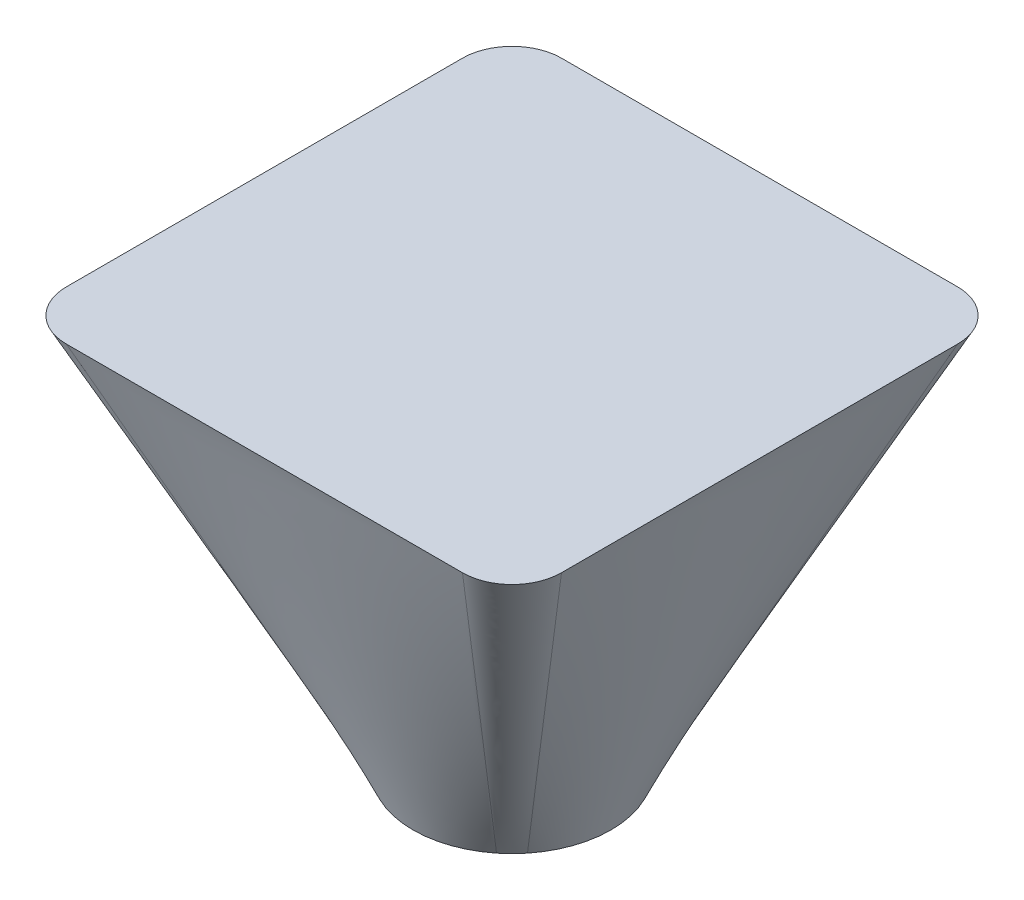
ISO-10303-21;
HEADER;
FILE_DESCRIPTION(('STEP AP214'),'2;1');
FILE_NAME('part.step','',(''),(''),'','','');
FILE_SCHEMA(('AUTOMOTIVE_DESIGN { 1 0 10303 214 1 1 1 1 }'));
ENDSEC;
DATA;
#1=APPLICATION_CONTEXT('core data for automotive mechanical design processes');
#2=APPLICATION_PROTOCOL_DEFINITION('international standard','automotive_design',2000,#1);
#3=PRODUCT_CONTEXT('',#1,'mechanical');
#4=PRODUCT('Part','Part','',(#3));
#5=PRODUCT_RELATED_PRODUCT_CATEGORY('part','',(#4));
#6=PRODUCT_DEFINITION_FORMATION('','',#4);
#7=PRODUCT_DEFINITION_CONTEXT('part definition',#1,'design');
#8=PRODUCT_DEFINITION('design','',#6,#7);
#9=PRODUCT_DEFINITION_SHAPE('','',#8);
#10=(LENGTH_UNIT() NAMED_UNIT(*) SI_UNIT(.MILLI.,.METRE.));
#11=(NAMED_UNIT(*) PLANE_ANGLE_UNIT() SI_UNIT($,.RADIAN.));
#12=(NAMED_UNIT(*) SI_UNIT($,.STERADIAN.) SOLID_ANGLE_UNIT());
#13=UNCERTAINTY_MEASURE_WITH_UNIT(LENGTH_MEASURE(1.E-05),#10,'distance_accuracy_value','');
#14=(GEOMETRIC_REPRESENTATION_CONTEXT(3) GLOBAL_UNCERTAINTY_ASSIGNED_CONTEXT((#13)) GLOBAL_UNIT_ASSIGNED_CONTEXT((#10,
#11,#12)) REPRESENTATION_CONTEXT('',''));
#15=CARTESIAN_POINT('',(0.,0.,0.));
#16=DIRECTION('',(0.,0.,1.));
#17=DIRECTION('',(1.,0.,0.));
#18=AXIS2_PLACEMENT_3D('',#15,#16,#17);
#19=CARTESIAN_POINT('',(-40.,0.,-40.));
#20=DIRECTION('',(0.,-1.,0.));
#21=DIRECTION('',(0.,0.,-1.));
#22=AXIS2_PLACEMENT_3D('',#19,#20,#21);
#23=PLANE('',#22);
#24=CARTESIAN_POINT('',(-40.,0.,-40.));
#25=DIRECTION('',(0.,1.,0.));
#26=DIRECTION('',(0.,0.,-1.));
#27=AXIS2_PLACEMENT_3D('',#24,#25,#26);
#28=CIRCLE('',#27,10.);
#29=CARTESIAN_POINT('',(-39.9999999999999,0.,-50.));
#30=VERTEX_POINT('',#29);
#31=CARTESIAN_POINT('',(-50.,0.,-39.9999999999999));
#32=VERTEX_POINT('',#31);
#33=EDGE_CURVE('E212',#30,#32,#28,.T.);
#34=ORIENTED_EDGE('',*,*,#33,.T.);
#35=DIRECTION('',(0.,0.,1.));
#36=VECTOR('',#35,1.);
#37=CARTESIAN_POINT('',(-50.,0.,39.9999999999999));
#38=LINE('',#37,#36);
#39=CARTESIAN_POINT('',(-50.,0.,39.9999999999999));
#40=VERTEX_POINT('',#39);
#41=EDGE_CURVE('E457',#32,#40,#38,.T.);
#42=ORIENTED_EDGE('',*,*,#41,.T.);
#43=CARTESIAN_POINT('',(-40.,0.,40.));
#44=DIRECTION('',(0.,1.,0.));
#45=DIRECTION('',(0.,0.,-1.));
#46=AXIS2_PLACEMENT_3D('',#43,#44,#45);
#47=CIRCLE('',#46,10.);
#48=CARTESIAN_POINT('',(-39.9999999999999,0.,50.));
#49=VERTEX_POINT('',#48);
#50=EDGE_CURVE('E449',#40,#49,#47,.T.);
#51=ORIENTED_EDGE('',*,*,#50,.T.);
#52=DIRECTION('',(1.,0.,0.));
#53=VECTOR('',#52,1.);
#54=CARTESIAN_POINT('',(-39.9999999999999,0.,50.));
#55=LINE('',#54,#53);
#56=CARTESIAN_POINT('',(39.9999999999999,0.,50.));
#57=VERTEX_POINT('',#56);
#58=EDGE_CURVE('E441',#49,#57,#55,.T.);
#59=ORIENTED_EDGE('',*,*,#58,.T.);
#60=CARTESIAN_POINT('',(40.,0.,40.));
#61=DIRECTION('',(0.,1.,0.));
#62=DIRECTION('',(0.,0.,1.));
#63=AXIS2_PLACEMENT_3D('',#60,#61,#62);
#64=CIRCLE('',#63,10.);
#65=CARTESIAN_POINT('',(50.,0.,39.9999999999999));
#66=VERTEX_POINT('',#65);
#67=EDGE_CURVE('E421',#57,#66,#64,.T.);
#68=ORIENTED_EDGE('',*,*,#67,.T.);
#69=DIRECTION('',(0.,0.,-1.));
#70=VECTOR('',#69,1.);
#71=CARTESIAN_POINT('',(50.,0.,39.9999999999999));
#72=LINE('',#71,#70);
#73=CARTESIAN_POINT('',(50.,0.,-39.9999999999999));
#74=VERTEX_POINT('',#73);
#75=EDGE_CURVE('E358',#66,#74,#72,.T.);
#76=ORIENTED_EDGE('',*,*,#75,.T.);
#77=CARTESIAN_POINT('',(40.,0.,-40.));
#78=DIRECTION('',(0.,1.,0.));
#79=DIRECTION('',(0.,0.,-1.));
#80=AXIS2_PLACEMENT_3D('',#77,#78,#79);
#81=CIRCLE('',#80,10.);
#82=CARTESIAN_POINT('',(39.9999999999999,0.,-50.));
#83=VERTEX_POINT('',#82);
#84=EDGE_CURVE('E157',#74,#83,#81,.T.);
#85=ORIENTED_EDGE('',*,*,#84,.T.);
#86=DIRECTION('',(-1.,0.,0.));
#87=VECTOR('',#86,1.);
#88=CARTESIAN_POINT('',(-39.9999999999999,0.,-50.));
#89=LINE('',#88,#87);
#90=EDGE_CURVE('E162',#83,#30,#89,.T.);
#91=ORIENTED_EDGE('',*,*,#90,.T.);
#92=EDGE_LOOP('',(#34,#42,#51,#59,#68,#76,#85,#91));
#93=FACE_BOUND('',#92,.T.);
#94=ADVANCED_FACE('F109',(#93),#23,.F.);
#95=CARTESIAN_POINT('',(0.,-80.,0.));
#96=DIRECTION('',(0.,1.,0.));
#97=DIRECTION('',(0.,0.,1.));
#98=AXIS2_PLACEMENT_3D('',#95,#96,#97);
#99=PLANE('',#98);
#100=CARTESIAN_POINT('',(0.,-80.,0.));
#101=DIRECTION('',(0.,1.,0.));
#102=DIRECTION('',(0.,0.,1.));
#103=AXIS2_PLACEMENT_3D('',#100,#101,#102);
#104=CIRCLE('',#103,20.);
#105=CARTESIAN_POINT('',(-15.6173761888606,-80.,12.4939009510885));
#106=VERTEX_POINT('',#105);
#107=CARTESIAN_POINT('',(-12.4939009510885,-80.,15.6173761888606));
#108=VERTEX_POINT('',#107);
#109=EDGE_CURVE('E268',#106,#108,#104,.T.);
#110=ORIENTED_EDGE('',*,*,#109,.F.);
#111=CARTESIAN_POINT('',(0.,-80.,0.));
#112=DIRECTION('',(0.,1.,0.));
#113=DIRECTION('',(0.,0.,1.));
#114=AXIS2_PLACEMENT_3D('',#111,#112,#113);
#115=CIRCLE('',#114,20.);
#116=CARTESIAN_POINT('',(-15.6173761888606,-80.,-12.4939009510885));
#117=VERTEX_POINT('',#116);
#118=EDGE_CURVE('E12',#117,#106,#115,.T.);
#119=ORIENTED_EDGE('',*,*,#118,.F.);
#120=CARTESIAN_POINT('',(0.,-80.,0.));
#121=DIRECTION('',(0.,1.,0.));
#122=DIRECTION('',(0.,0.,1.));
#123=AXIS2_PLACEMENT_3D('',#120,#121,#122);
#124=CIRCLE('',#123,20.);
#125=CARTESIAN_POINT('',(-12.4939009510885,-80.,-15.6173761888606));
#126=VERTEX_POINT('',#125);
#127=EDGE_CURVE('E120',#126,#117,#124,.T.);
#128=ORIENTED_EDGE('',*,*,#127,.F.);
#129=CARTESIAN_POINT('',(0.,-80.,0.));
#130=DIRECTION('',(0.,1.,0.));
#131=DIRECTION('',(0.,0.,1.));
#132=AXIS2_PLACEMENT_3D('',#129,#130,#131);
#133=CIRCLE('',#132,20.);
#134=CARTESIAN_POINT('',(12.4939009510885,-80.,-15.6173761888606));
#135=VERTEX_POINT('',#134);
#136=EDGE_CURVE('E189',#135,#126,#133,.T.);
#137=ORIENTED_EDGE('',*,*,#136,.F.);
#138=CARTESIAN_POINT('',(0.,-80.,0.));
#139=DIRECTION('',(0.,1.,0.));
#140=DIRECTION('',(0.,0.,1.));
#141=AXIS2_PLACEMENT_3D('',#138,#139,#140);
#142=CIRCLE('',#141,20.);
#143=CARTESIAN_POINT('',(15.6173761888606,-80.,-12.4939009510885));
#144=VERTEX_POINT('',#143);
#145=EDGE_CURVE('E207',#144,#135,#142,.T.);
#146=ORIENTED_EDGE('',*,*,#145,.F.);
#147=CARTESIAN_POINT('',(0.,-80.,0.));
#148=DIRECTION('',(0.,1.,0.));
#149=DIRECTION('',(0.,0.,1.));
#150=AXIS2_PLACEMENT_3D('',#147,#148,#149);
#151=CIRCLE('',#150,20.);
#152=CARTESIAN_POINT('',(15.6173761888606,-80.,12.4939009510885));
#153=VERTEX_POINT('',#152);
#154=EDGE_CURVE('E336',#153,#144,#151,.T.);
#155=ORIENTED_EDGE('',*,*,#154,.F.);
#156=CARTESIAN_POINT('',(0.,-80.,0.));
#157=DIRECTION('',(0.,1.,0.));
#158=DIRECTION('',(0.,0.,1.));
#159=AXIS2_PLACEMENT_3D('',#156,#157,#158);
#160=CIRCLE('',#159,20.);
#161=CARTESIAN_POINT('',(12.4939009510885,-80.,15.6173761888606));
#162=VERTEX_POINT('',#161);
#163=EDGE_CURVE('E333',#162,#153,#160,.T.);
#164=ORIENTED_EDGE('',*,*,#163,.F.);
#165=CARTESIAN_POINT('',(0.,-80.,0.));
#166=DIRECTION('',(0.,1.,0.));
#167=DIRECTION('',(0.,0.,1.));
#168=AXIS2_PLACEMENT_3D('',#165,#166,#167);
#169=CIRCLE('',#168,20.);
#170=EDGE_CURVE('E172',#108,#162,#169,.T.);
#171=ORIENTED_EDGE('',*,*,#170,.F.);
#172=EDGE_LOOP('',(#110,#119,#128,#137,#146,#155,#164,#171));
#173=FACE_BOUND('',#172,.T.);
#174=ADVANCED_FACE('F188',(#173),#99,.F.);
#175=CARTESIAN_POINT('',(15.6173761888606,-80.,12.4939009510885));
#176=CARTESIAN_POINT('',(50.,0.,39.9999999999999));
#177=CARTESIAN_POINT('',(16.2677826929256,-80.,11.6808928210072));
#178=CARTESIAN_POINT('',(50.,0.,36.6666666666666));
#179=CARTESIAN_POINT('',(16.8724921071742,-80.,10.7942079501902));
#180=CARTESIAN_POINT('',(50.,0.,33.3333333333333));
#181=CARTESIAN_POINT('',(17.9488157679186,-80.,8.89021527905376));
#182=CARTESIAN_POINT('',(50.,0.,26.6666666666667));
#183=CARTESIAN_POINT('',(18.4202066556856,-80.,7.87291514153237));
#184=CARTESIAN_POINT('',(50.,0.,23.3333333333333));
#185=CARTESIAN_POINT('',(19.1922902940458,-80.,5.73958180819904));
#186=CARTESIAN_POINT('',(50.,0.,16.6666666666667));
#187=CARTESIAN_POINT('',(19.4927686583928,-80.,4.623675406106));
#188=CARTESIAN_POINT('',(50.,0.,13.3333333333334));
#189=CARTESIAN_POINT('',(19.8966899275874,-80.,2.33840419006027));
#190=CARTESIAN_POINT('',(50.,0.,6.66666666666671));
#191=CARTESIAN_POINT('',(20.,-80.,1.16927019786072));
#192=CARTESIAN_POINT('',(50.,0.,3.33333333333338));
#193=CARTESIAN_POINT('',(20.,-80.,-1.1692701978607));
#194=CARTESIAN_POINT('',(50.,0.,-3.33333333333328));
#195=CARTESIAN_POINT('',(19.8966899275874,-80.,-2.33840419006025));
#196=CARTESIAN_POINT('',(50.,0.,-6.6666666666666));
#197=CARTESIAN_POINT('',(19.4927686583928,-80.,-4.62367540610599));
#198=CARTESIAN_POINT('',(50.,0.,-13.3333333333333));
#199=CARTESIAN_POINT('',(19.1922902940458,-80.,-5.73958180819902));
#200=CARTESIAN_POINT('',(50.,0.,-16.6666666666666));
#201=CARTESIAN_POINT('',(18.4202066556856,-80.,-7.87291514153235));
#202=CARTESIAN_POINT('',(50.,0.,-23.3333333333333));
#203=CARTESIAN_POINT('',(17.9488157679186,-80.,-8.89021527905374));
#204=CARTESIAN_POINT('',(50.,0.,-26.6666666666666));
#205=CARTESIAN_POINT('',(16.8724921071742,-80.,-10.7942079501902));
#206=CARTESIAN_POINT('',(50.,0.,-33.3333333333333));
#207=CARTESIAN_POINT('',(16.2677826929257,-80.,-11.6808928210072));
#208=CARTESIAN_POINT('',(50.,0.,-36.6666666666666));
#209=CARTESIAN_POINT('',(15.6173761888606,-80.,-12.4939009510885));
#210=CARTESIAN_POINT('',(50.,0.,-39.9999999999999));
#211=B_SPLINE_SURFACE_WITH_KNOTS('',3,1,((#175,#176),(#177,#178),(#179,#180),(#181,#182),(#183,
#184),(#185,#186),(#187,#188),(#189,#190),(#191,#192),(#193,#194),(#195,#196),(#197,#198),(#199,
#200),(#201,#202),(#203,#204),(#205,#206),(#207,#208),(#209,#210)),.UNSPECIFIED.,.F.,.F.,.F.,(4,
2,2,2,2,2,2,2,4),(2,2),(0.,0.125,0.25,0.375,0.5,0.625,0.75,0.875,1.),(0.,1.),.UNSPECIFIED.);
#212=DIRECTION('',(0.376520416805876,0.876071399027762,-0.3012163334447));
#213=VECTOR('',#212,1.);
#214=CARTESIAN_POINT('',(32.8086880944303,-40.,-26.2469504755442));
#215=LINE('',#214,#213);
#216=EDGE_CURVE('E360',#144,#74,#215,.T.);
#217=DIRECTION('',(-0.376520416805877,-0.876071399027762,-0.301216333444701));
#218=VECTOR('',#217,1.);
#219=CARTESIAN_POINT('',(32.8086880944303,-40.,26.2469504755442));
#220=LINE('',#219,#218);
#221=EDGE_CURVE('E216',#66,#153,#220,.T.);
#222=ORIENTED_EDGE('',*,*,#154,.T.);
#223=ORIENTED_EDGE('',*,*,#216,.T.);
#224=ORIENTED_EDGE('',*,*,#75,.F.);
#225=ORIENTED_EDGE('',*,*,#221,.T.);
#226=EDGE_LOOP('',(#222,#223,#224,#225));
#227=FACE_BOUND('',#226,.T.);
#228=ADVANCED_FACE('F291',(#227),#211,.T.);
#229=CARTESIAN_POINT('',(15.6173761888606,-80.,-12.4939009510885));
#230=CARTESIAN_POINT('',(50.,0.,-39.9999999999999));
#231=CARTESIAN_POINT('',(15.5023994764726,-80.,-12.6376218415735));
#232=CARTESIAN_POINT('',(50.,0.,-40.5892556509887));
#233=CARTESIAN_POINT('',(15.385327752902,-80.,-12.779844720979));
#234=CARTESIAN_POINT('',(49.9476165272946,0.,-41.2005473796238));
#235=CARTESIAN_POINT('',(15.1471435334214,-80.,-13.0611452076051));
#236=CARTESIAN_POINT('',(49.7184908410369,0.,-42.4387136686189));
#237=CARTESIAN_POINT('',(15.0260310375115,-80.,-13.2002228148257));
#238=CARTESIAN_POINT('',(49.5415478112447,0.,-43.0654623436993));
#239=CARTESIAN_POINT('',(14.779914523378,-80.,-13.4750835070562));
#240=CARTESIAN_POINT('',(49.0542182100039,0.,-44.2964318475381));
#241=CARTESIAN_POINT('',(14.6549105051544,-80.,-13.6108665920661));
#242=CARTESIAN_POINT('',(48.7437166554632,0.,-44.9004031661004));
#243=CARTESIAN_POINT('',(14.4011601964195,-80.,-13.8789889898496));
#244=CARTESIAN_POINT('',(47.9961935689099,0.,-46.0437919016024));
#245=CARTESIAN_POINT('',(14.2724139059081,-80.,-14.0113283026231));
#246=CARTESIAN_POINT('',(47.5592231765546,0.,-46.5829124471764));
#247=CARTESIAN_POINT('',(14.0113283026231,-80.,-14.2724139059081));
#248=CARTESIAN_POINT('',(46.5829124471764,0.,-47.5592231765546));
#249=CARTESIAN_POINT('',(13.8789889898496,-80.,-14.4011601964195));
#250=CARTESIAN_POINT('',(46.0437919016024,0.,-47.9961935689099));
#251=CARTESIAN_POINT('',(13.6108665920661,-80.,-14.6549105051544));
#252=CARTESIAN_POINT('',(44.9004031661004,0.,-48.7437166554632));
#253=CARTESIAN_POINT('',(13.4750835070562,-80.,-14.779914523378));
#254=CARTESIAN_POINT('',(44.2964318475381,0.,-49.0542182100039));
#255=CARTESIAN_POINT('',(13.2002228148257,-80.,-15.0260310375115));
#256=CARTESIAN_POINT('',(43.0654623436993,0.,-49.5415478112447));
#257=CARTESIAN_POINT('',(13.0611452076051,-80.,-15.1471435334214));
#258=CARTESIAN_POINT('',(42.438713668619,0.,-49.7184908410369));
#259=CARTESIAN_POINT('',(12.779844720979,-80.,-15.385327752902));
#260=CARTESIAN_POINT('',(41.2005473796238,0.,-49.9476165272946));
#261=CARTESIAN_POINT('',(12.6376218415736,-80.,-15.5023994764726));
#262=CARTESIAN_POINT('',(40.5892556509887,0.,-50.));
#263=CARTESIAN_POINT('',(12.4939009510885,-80.,-15.6173761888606));
#264=CARTESIAN_POINT('',(39.9999999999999,0.,-50.));
#265=B_SPLINE_SURFACE_WITH_KNOTS('',3,1,((#229,#230),(#231,#232),(#233,#234),(#235,#236),(#237,
#238),(#239,#240),(#241,#242),(#243,#244),(#245,#246),(#247,#248),(#249,#250),(#251,#252),(#253,
#254),(#255,#256),(#257,#258),(#259,#260),(#261,#262),(#263,#264)),.UNSPECIFIED.,.F.,.F.,.F.,(4,
2,2,2,2,2,2,2,4),(2,2),(0.,0.125,0.25,0.375,0.5,0.625,0.75,0.875,1.),(0.,1.),.UNSPECIFIED.);
#266=DIRECTION('',(0.3012163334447,0.876071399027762,-0.376520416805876));
#267=VECTOR('',#266,1.);
#268=CARTESIAN_POINT('',(26.2469504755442,-40.,-32.8086880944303));
#269=LINE('',#268,#267);
#270=EDGE_CURVE('E206',#135,#83,#269,.T.);
#271=ORIENTED_EDGE('',*,*,#145,.T.);
#272=ORIENTED_EDGE('',*,*,#270,.T.);
#273=ORIENTED_EDGE('',*,*,#84,.F.);
#274=ORIENTED_EDGE('',*,*,#216,.F.);
#275=EDGE_LOOP('',(#271,#272,#273,#274));
#276=FACE_BOUND('',#275,.T.);
#277=ADVANCED_FACE('F382',(#276),#265,.T.);
#278=CARTESIAN_POINT('',(12.4939009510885,-80.,15.6173761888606));
#279=CARTESIAN_POINT('',(40.,0.,50.));
#280=CARTESIAN_POINT('',(12.6376218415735,-80.,15.5023994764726));
#281=CARTESIAN_POINT('',(40.5892556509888,0.,50.));
#282=CARTESIAN_POINT('',(12.779844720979,-80.,15.385327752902));
#283=CARTESIAN_POINT('',(41.2005473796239,0.,49.9476165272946));
#284=CARTESIAN_POINT('',(13.0611452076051,-80.,15.1471435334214));
#285=CARTESIAN_POINT('',(42.438713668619,0.,49.7184908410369));
#286=CARTESIAN_POINT('',(13.2002228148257,-80.,15.0260310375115));
#287=CARTESIAN_POINT('',(43.0654623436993,0.,49.5415478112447));
#288=CARTESIAN_POINT('',(13.4750835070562,-80.,14.779914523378));
#289=CARTESIAN_POINT('',(44.2964318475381,0.,49.0542182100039));
#290=CARTESIAN_POINT('',(13.6108665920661,-80.,14.6549105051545));
#291=CARTESIAN_POINT('',(44.9004031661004,0.,48.7437166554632));
#292=CARTESIAN_POINT('',(13.8789889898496,-80.,14.4011601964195));
#293=CARTESIAN_POINT('',(46.0437919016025,0.,47.9961935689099));
#294=CARTESIAN_POINT('',(14.0113283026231,-80.,14.2724139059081));
#295=CARTESIAN_POINT('',(46.5829124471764,0.,47.5592231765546));
#296=CARTESIAN_POINT('',(14.2724139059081,-80.,14.0113283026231));
#297=CARTESIAN_POINT('',(47.5592231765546,0.,46.5829124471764));
#298=CARTESIAN_POINT('',(14.4011601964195,-80.,13.8789889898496));
#299=CARTESIAN_POINT('',(47.9961935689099,0.,46.0437919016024));
#300=CARTESIAN_POINT('',(14.6549105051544,-80.,13.6108665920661));
#301=CARTESIAN_POINT('',(48.7437166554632,0.,44.9004031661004));
#302=CARTESIAN_POINT('',(14.779914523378,-80.,13.4750835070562));
#303=CARTESIAN_POINT('',(49.054218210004,0.,44.2964318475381));
#304=CARTESIAN_POINT('',(15.0260310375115,-80.,13.2002228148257));
#305=CARTESIAN_POINT('',(49.5415478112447,0.,43.0654623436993));
#306=CARTESIAN_POINT('',(15.1471435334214,-80.,13.0611452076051));
#307=CARTESIAN_POINT('',(49.7184908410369,0.,42.438713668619));
#308=CARTESIAN_POINT('',(15.385327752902,-80.,12.779844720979));
#309=CARTESIAN_POINT('',(49.9476165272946,0.,41.2005473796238));
#310=CARTESIAN_POINT('',(15.5023994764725,-80.,12.6376218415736));
#311=CARTESIAN_POINT('',(50.,0.,40.5892556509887));
#312=CARTESIAN_POINT('',(15.6173761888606,-80.,12.4939009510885));
#313=CARTESIAN_POINT('',(50.,0.,39.9999999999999));
#314=B_SPLINE_SURFACE_WITH_KNOTS('',3,1,((#278,#279),(#280,#281),(#282,#283),(#284,#285),(#286,
#287),(#288,#289),(#290,#291),(#292,#293),(#294,#295),(#296,#297),(#298,#299),(#300,#301),(#302,
#303),(#304,#305),(#306,#307),(#308,#309),(#310,#311),(#312,#313)),.UNSPECIFIED.,.F.,.F.,.F.,(4,
2,2,2,2,2,2,2,4),(2,2),(0.,0.125,0.25,0.375,0.5,0.625,0.75,0.875,1.),(0.,1.),.UNSPECIFIED.);
#315=DIRECTION('',(0.301216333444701,0.876071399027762,0.376520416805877));
#316=VECTOR('',#315,1.);
#317=CARTESIAN_POINT('',(26.2469504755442,-40.,32.8086880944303));
#318=LINE('',#317,#316);
#319=EDGE_CURVE('E354',#162,#57,#318,.T.);
#320=ORIENTED_EDGE('',*,*,#163,.T.);
#321=ORIENTED_EDGE('',*,*,#221,.F.);
#322=ORIENTED_EDGE('',*,*,#67,.F.);
#323=ORIENTED_EDGE('',*,*,#319,.F.);
#324=EDGE_LOOP('',(#320,#321,#322,#323));
#325=FACE_BOUND('',#324,.T.);
#326=ADVANCED_FACE('F351',(#325),#314,.T.);
#327=CARTESIAN_POINT('',(12.4939009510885,-80.,-15.6173761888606));
#328=CARTESIAN_POINT('',(39.9999999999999,0.,-50.));
#329=CARTESIAN_POINT('',(11.6808928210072,-80.,-16.2677826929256));
#330=CARTESIAN_POINT('',(36.6666666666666,0.,-50.));
#331=CARTESIAN_POINT('',(10.7942079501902,-80.,-16.8724921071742));
#332=CARTESIAN_POINT('',(33.3333333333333,0.,-50.));
#333=CARTESIAN_POINT('',(8.89021527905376,-80.,-17.9488157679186));
#334=CARTESIAN_POINT('',(26.6666666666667,0.,-50.));
#335=CARTESIAN_POINT('',(7.87291514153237,-80.,-18.4202066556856));
#336=CARTESIAN_POINT('',(23.3333333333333,0.,-50.));
#337=CARTESIAN_POINT('',(5.73958180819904,-80.,-19.1922902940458));
#338=CARTESIAN_POINT('',(16.6666666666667,0.,-50.));
#339=CARTESIAN_POINT('',(4.62367540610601,-80.,-19.4927686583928));
#340=CARTESIAN_POINT('',(13.3333333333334,0.,-50.));
#341=CARTESIAN_POINT('',(2.33840419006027,-80.,-19.8966899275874));
#342=CARTESIAN_POINT('',(6.66666666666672,0.,-50.));
#343=CARTESIAN_POINT('',(1.16927019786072,-80.,-20.));
#344=CARTESIAN_POINT('',(3.33333333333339,0.,-50.));
#345=CARTESIAN_POINT('',(-1.16927019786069,-80.,-20.));
#346=CARTESIAN_POINT('',(-3.33333333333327,0.,-50.));
#347=CARTESIAN_POINT('',(-2.33840419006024,-80.,-19.8966899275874));
#348=CARTESIAN_POINT('',(-6.66666666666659,0.,-50.));
#349=CARTESIAN_POINT('',(-4.62367540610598,-80.,-19.4927686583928));
#350=CARTESIAN_POINT('',(-13.3333333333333,0.,-50.));
#351=CARTESIAN_POINT('',(-5.73958180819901,-80.,-19.1922902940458));
#352=CARTESIAN_POINT('',(-16.6666666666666,0.,-50.));
#353=CARTESIAN_POINT('',(-7.87291514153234,-80.,-18.4202066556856));
#354=CARTESIAN_POINT('',(-23.3333333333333,0.,-50.));
#355=CARTESIAN_POINT('',(-8.89021527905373,-80.,-17.9488157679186));
#356=CARTESIAN_POINT('',(-26.6666666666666,0.,-50.));
#357=CARTESIAN_POINT('',(-10.7942079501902,-80.,-16.8724921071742));
#358=CARTESIAN_POINT('',(-33.3333333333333,0.,-50.));
#359=CARTESIAN_POINT('',(-11.6808928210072,-80.,-16.2677826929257));
#360=CARTESIAN_POINT('',(-36.6666666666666,0.,-50.));
#361=CARTESIAN_POINT('',(-12.4939009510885,-80.,-15.6173761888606));
#362=CARTESIAN_POINT('',(-39.9999999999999,0.,-50.));
#363=B_SPLINE_SURFACE_WITH_KNOTS('',3,1,((#327,#328),(#329,#330),(#331,#332),(#333,#334),(#335,
#336),(#337,#338),(#339,#340),(#341,#342),(#343,#344),(#345,#346),(#347,#348),(#349,#350),(#351,
#352),(#353,#354),(#355,#356),(#357,#358),(#359,#360),(#361,#362)),.UNSPECIFIED.,.F.,.F.,.F.,(4,
2,2,2,2,2,2,2,4),(2,2),(0.,0.125,0.25,0.375,0.5,0.625,0.75,0.875,1.),(0.,1.),.UNSPECIFIED.);
#364=DIRECTION('',(-0.301216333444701,0.876071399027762,-0.376520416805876));
#365=VECTOR('',#364,1.);
#366=CARTESIAN_POINT('',(-26.2469504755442,-40.,-32.8086880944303));
#367=LINE('',#366,#365);
#368=EDGE_CURVE('E204',#126,#30,#367,.T.);
#369=ORIENTED_EDGE('',*,*,#136,.T.);
#370=ORIENTED_EDGE('',*,*,#368,.T.);
#371=ORIENTED_EDGE('',*,*,#90,.F.);
#372=ORIENTED_EDGE('',*,*,#270,.F.);
#373=EDGE_LOOP('',(#369,#370,#371,#372));
#374=FACE_BOUND('',#373,.T.);
#375=ADVANCED_FACE('F203',(#374),#363,.T.);
#376=CARTESIAN_POINT('',(-12.4939009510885,-80.,-15.6173761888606));
#377=CARTESIAN_POINT('',(-40.,0.,-50.));
#378=CARTESIAN_POINT('',(-12.6376218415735,-80.,-15.5023994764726));
#379=CARTESIAN_POINT('',(-40.5892556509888,0.,-50.));
#380=CARTESIAN_POINT('',(-12.779844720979,-80.,-15.385327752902));
#381=CARTESIAN_POINT('',(-41.2005473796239,0.,-49.9476165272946));
#382=CARTESIAN_POINT('',(-13.0611452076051,-80.,-15.1471435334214));
#383=CARTESIAN_POINT('',(-42.438713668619,0.,-49.7184908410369));
#384=CARTESIAN_POINT('',(-13.2002228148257,-80.,-15.0260310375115));
#385=CARTESIAN_POINT('',(-43.0654623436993,0.,-49.5415478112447));
#386=CARTESIAN_POINT('',(-13.4750835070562,-80.,-14.779914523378));
#387=CARTESIAN_POINT('',(-44.2964318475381,0.,-49.0542182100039));
#388=CARTESIAN_POINT('',(-13.6108665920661,-80.,-14.6549105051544));
#389=CARTESIAN_POINT('',(-44.9004031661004,0.,-48.7437166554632));
#390=CARTESIAN_POINT('',(-13.8789889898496,-80.,-14.4011601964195));
#391=CARTESIAN_POINT('',(-46.0437919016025,0.,-47.9961935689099));
#392=CARTESIAN_POINT('',(-14.0113283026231,-80.,-14.2724139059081));
#393=CARTESIAN_POINT('',(-46.5829124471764,0.,-47.5592231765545));
#394=CARTESIAN_POINT('',(-14.2724139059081,-80.,-14.0113283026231));
#395=CARTESIAN_POINT('',(-47.5592231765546,0.,-46.5829124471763));
#396=CARTESIAN_POINT('',(-14.4011601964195,-80.,-13.8789889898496));
#397=CARTESIAN_POINT('',(-47.9961935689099,0.,-46.0437919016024));
#398=CARTESIAN_POINT('',(-14.6549105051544,-80.,-13.6108665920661));
#399=CARTESIAN_POINT('',(-48.7437166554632,0.,-44.9004031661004));
#400=CARTESIAN_POINT('',(-14.779914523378,-80.,-13.4750835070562));
#401=CARTESIAN_POINT('',(-49.054218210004,0.,-44.2964318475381));
#402=CARTESIAN_POINT('',(-15.0260310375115,-80.,-13.2002228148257));
#403=CARTESIAN_POINT('',(-49.5415478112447,0.,-43.0654623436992));
#404=CARTESIAN_POINT('',(-15.1471435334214,-80.,-13.0611452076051));
#405=CARTESIAN_POINT('',(-49.7184908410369,0.,-42.4387136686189));
#406=CARTESIAN_POINT('',(-15.385327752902,-80.,-12.779844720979));
#407=CARTESIAN_POINT('',(-49.9476165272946,0.,-41.2005473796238));
#408=CARTESIAN_POINT('',(-15.5023994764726,-80.,-12.6376218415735));
#409=CARTESIAN_POINT('',(-50.,0.,-40.5892556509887));
#410=CARTESIAN_POINT('',(-15.6173761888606,-80.,-12.4939009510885));
#411=CARTESIAN_POINT('',(-50.,0.,-39.9999999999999));
#412=B_SPLINE_SURFACE_WITH_KNOTS('',3,1,((#376,#377),(#378,#379),(#380,#381),(#382,#383),(#384,
#385),(#386,#387),(#388,#389),(#390,#391),(#392,#393),(#394,#395),(#396,#397),(#398,#399),(#400,
#401),(#402,#403),(#404,#405),(#406,#407),(#408,#409),(#410,#411)),.UNSPECIFIED.,.F.,.F.,.F.,(4,
2,2,2,2,2,2,2,4),(2,2),(0.,0.125,0.25,0.375,0.5,0.625,0.75,0.875,1.),(0.,1.),.UNSPECIFIED.);
#413=DIRECTION('',(-0.376520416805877,0.876071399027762,-0.3012163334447));
#414=VECTOR('',#413,1.);
#415=CARTESIAN_POINT('',(-32.8086880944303,-40.,-26.2469504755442));
#416=LINE('',#415,#414);
#417=EDGE_CURVE('E214',#117,#32,#416,.T.);
#418=ORIENTED_EDGE('',*,*,#127,.T.);
#419=ORIENTED_EDGE('',*,*,#417,.T.);
#420=ORIENTED_EDGE('',*,*,#33,.F.);
#421=ORIENTED_EDGE('',*,*,#368,.F.);
#422=EDGE_LOOP('',(#418,#419,#420,#421));
#423=FACE_BOUND('',#422,.T.);
#424=ADVANCED_FACE('F211',(#423),#412,.T.);
#425=CARTESIAN_POINT('',(-15.6173761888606,-80.,-12.4939009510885));
#426=CARTESIAN_POINT('',(-50.,0.,-39.9999999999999));
#427=CARTESIAN_POINT('',(-16.2677826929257,-80.,-11.6808928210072));
#428=CARTESIAN_POINT('',(-50.,0.,-36.6666666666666));
#429=CARTESIAN_POINT('',(-16.8724921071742,-80.,-10.7942079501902));
#430=CARTESIAN_POINT('',(-50.,0.,-33.3333333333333));
#431=CARTESIAN_POINT('',(-17.9488157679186,-80.,-8.89021527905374));
#432=CARTESIAN_POINT('',(-50.,0.,-26.6666666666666));
#433=CARTESIAN_POINT('',(-18.4202066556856,-80.,-7.87291514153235));
#434=CARTESIAN_POINT('',(-50.,0.,-23.3333333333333));
#435=CARTESIAN_POINT('',(-19.1922902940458,-80.,-5.73958180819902));
#436=CARTESIAN_POINT('',(-50.,0.,-16.6666666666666));
#437=CARTESIAN_POINT('',(-19.4927686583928,-80.,-4.62367540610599));
#438=CARTESIAN_POINT('',(-50.,0.,-13.3333333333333));
#439=CARTESIAN_POINT('',(-19.8966899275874,-80.,-2.33840419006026));
#440=CARTESIAN_POINT('',(-50.,0.,-6.66666666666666));
#441=CARTESIAN_POINT('',(-20.,-80.,-1.16927019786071));
#442=CARTESIAN_POINT('',(-50.,0.,-3.33333333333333));
#443=CARTESIAN_POINT('',(-20.,-80.,1.1692701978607));
#444=CARTESIAN_POINT('',(-50.,0.,3.33333333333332));
#445=CARTESIAN_POINT('',(-19.8966899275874,-80.,2.33840419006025));
#446=CARTESIAN_POINT('',(-50.,0.,6.66666666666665));
#447=CARTESIAN_POINT('',(-19.4927686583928,-80.,4.62367540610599));
#448=CARTESIAN_POINT('',(-50.,0.,13.3333333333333));
#449=CARTESIAN_POINT('',(-19.1922902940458,-80.,5.73958180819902));
#450=CARTESIAN_POINT('',(-50.,0.,16.6666666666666));
#451=CARTESIAN_POINT('',(-18.4202066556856,-80.,7.87291514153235));
#452=CARTESIAN_POINT('',(-50.,0.,23.3333333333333));
#453=CARTESIAN_POINT('',(-17.9488157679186,-80.,8.89021527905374));
#454=CARTESIAN_POINT('',(-50.,0.,26.6666666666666));
#455=CARTESIAN_POINT('',(-16.8724921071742,-80.,10.7942079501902));
#456=CARTESIAN_POINT('',(-50.,0.,33.3333333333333));
#457=CARTESIAN_POINT('',(-16.2677826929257,-80.,11.6808928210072));
#458=CARTESIAN_POINT('',(-50.,0.,36.6666666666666));
#459=CARTESIAN_POINT('',(-15.6173761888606,-80.,12.4939009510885));
#460=CARTESIAN_POINT('',(-50.,0.,39.9999999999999));
#461=B_SPLINE_SURFACE_WITH_KNOTS('',3,1,((#425,#426),(#427,#428),(#429,#430),(#431,#432),(#433,
#434),(#435,#436),(#437,#438),(#439,#440),(#441,#442),(#443,#444),(#445,#446),(#447,#448),(#449,
#450),(#451,#452),(#453,#454),(#455,#456),(#457,#458),(#459,#460)),.UNSPECIFIED.,.F.,.F.,.F.,(4,
2,2,2,2,2,2,2,4),(2,2),(0.,0.125,0.25,0.375,0.5,0.625,0.75,0.875,1.),(0.,1.),.UNSPECIFIED.);
#462=DIRECTION('',(-0.376520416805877,0.876071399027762,0.301216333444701));
#463=VECTOR('',#462,1.);
#464=CARTESIAN_POINT('',(-32.8086880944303,-40.,26.2469504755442));
#465=LINE('',#464,#463);
#466=EDGE_CURVE('E129',#106,#40,#465,.T.);
#467=ORIENTED_EDGE('',*,*,#118,.T.);
#468=ORIENTED_EDGE('',*,*,#466,.T.);
#469=ORIENTED_EDGE('',*,*,#41,.F.);
#470=ORIENTED_EDGE('',*,*,#417,.F.);
#471=EDGE_LOOP('',(#467,#468,#469,#470));
#472=FACE_BOUND('',#471,.T.);
#473=ADVANCED_FACE('F241',(#472),#461,.T.);
#474=CARTESIAN_POINT('',(-15.6173761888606,-80.,12.4939009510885));
#475=CARTESIAN_POINT('',(-50.,0.,39.9999999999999));
#476=CARTESIAN_POINT('',(-15.5023994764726,-80.,12.6376218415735));
#477=CARTESIAN_POINT('',(-50.,0.,40.5892556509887));
#478=CARTESIAN_POINT('',(-15.385327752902,-80.,12.779844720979));
#479=CARTESIAN_POINT('',(-49.9476165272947,0.,41.2005473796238));
#480=CARTESIAN_POINT('',(-15.1471435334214,-80.,13.0611452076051));
#481=CARTESIAN_POINT('',(-49.7184908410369,0.,42.438713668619));
#482=CARTESIAN_POINT('',(-15.0260310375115,-80.,13.2002228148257));
#483=CARTESIAN_POINT('',(-49.5415478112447,0.,43.0654623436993));
#484=CARTESIAN_POINT('',(-14.779914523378,-80.,13.4750835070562));
#485=CARTESIAN_POINT('',(-49.054218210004,0.,44.2964318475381));
#486=CARTESIAN_POINT('',(-14.6549105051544,-80.,13.6108665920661));
#487=CARTESIAN_POINT('',(-48.7437166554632,0.,44.9004031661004));
#488=CARTESIAN_POINT('',(-14.4011601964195,-80.,13.8789889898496));
#489=CARTESIAN_POINT('',(-47.9961935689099,0.,46.0437919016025));
#490=CARTESIAN_POINT('',(-14.2724139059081,-80.,14.0113283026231));
#491=CARTESIAN_POINT('',(-47.5592231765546,0.,46.5829124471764));
#492=CARTESIAN_POINT('',(-14.0113283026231,-80.,14.2724139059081));
#493=CARTESIAN_POINT('',(-46.5829124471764,0.,47.5592231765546));
#494=CARTESIAN_POINT('',(-13.8789889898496,-80.,14.4011601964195));
#495=CARTESIAN_POINT('',(-46.0437919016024,0.,47.9961935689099));
#496=CARTESIAN_POINT('',(-13.6108665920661,-80.,14.6549105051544));
#497=CARTESIAN_POINT('',(-44.9004031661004,0.,48.7437166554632));
#498=CARTESIAN_POINT('',(-13.4750835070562,-80.,14.779914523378));
#499=CARTESIAN_POINT('',(-44.2964318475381,0.,49.054218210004));
#500=CARTESIAN_POINT('',(-13.2002228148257,-80.,15.0260310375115));
#501=CARTESIAN_POINT('',(-43.0654623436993,0.,49.5415478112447));
#502=CARTESIAN_POINT('',(-13.0611452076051,-80.,15.1471435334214));
#503=CARTESIAN_POINT('',(-42.438713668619,0.,49.7184908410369));
#504=CARTESIAN_POINT('',(-12.779844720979,-80.,15.385327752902));
#505=CARTESIAN_POINT('',(-41.2005473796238,0.,49.9476165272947));
#506=CARTESIAN_POINT('',(-12.6376218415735,-80.,15.5023994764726));
#507=CARTESIAN_POINT('',(-40.5892556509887,0.,50.));
#508=CARTESIAN_POINT('',(-12.4939009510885,-80.,15.6173761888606));
#509=CARTESIAN_POINT('',(-39.9999999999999,0.,50.));
#510=B_SPLINE_SURFACE_WITH_KNOTS('',3,1,((#474,#475),(#476,#477),(#478,#479),(#480,#481),(#482,
#483),(#484,#485),(#486,#487),(#488,#489),(#490,#491),(#492,#493),(#494,#495),(#496,#497),(#498,
#499),(#500,#501),(#502,#503),(#504,#505),(#506,#507),(#508,#509)),.UNSPECIFIED.,.F.,.F.,.F.,(4,
2,2,2,2,2,2,2,4),(2,2),(0.,0.125,0.25,0.375,0.5,0.625,0.75,0.875,1.),(0.,1.),.UNSPECIFIED.);
#511=DIRECTION('',(-0.301216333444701,0.876071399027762,0.376520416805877));
#512=VECTOR('',#511,1.);
#513=CARTESIAN_POINT('',(-26.2469504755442,-40.,32.8086880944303));
#514=LINE('',#513,#512);
#515=EDGE_CURVE('E477',#108,#49,#514,.T.);
#516=ORIENTED_EDGE('',*,*,#109,.T.);
#517=ORIENTED_EDGE('',*,*,#515,.T.);
#518=ORIENTED_EDGE('',*,*,#50,.F.);
#519=ORIENTED_EDGE('',*,*,#466,.F.);
#520=EDGE_LOOP('',(#516,#517,#518,#519));
#521=FACE_BOUND('',#520,.T.);
#522=ADVANCED_FACE('F475',(#521),#510,.T.);
#523=CARTESIAN_POINT('',(-12.4939009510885,-80.,15.6173761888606));
#524=CARTESIAN_POINT('',(-39.9999999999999,0.,50.));
#525=CARTESIAN_POINT('',(-11.6808928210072,-80.,16.2677826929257));
#526=CARTESIAN_POINT('',(-36.6666666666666,0.,50.));
#527=CARTESIAN_POINT('',(-10.7942079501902,-80.,16.8724921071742));
#528=CARTESIAN_POINT('',(-33.3333333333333,0.,50.));
#529=CARTESIAN_POINT('',(-8.89021527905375,-80.,17.9488157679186));
#530=CARTESIAN_POINT('',(-26.6666666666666,0.,50.));
#531=CARTESIAN_POINT('',(-7.87291514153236,-80.,18.4202066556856));
#532=CARTESIAN_POINT('',(-23.3333333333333,0.,50.));
#533=CARTESIAN_POINT('',(-5.73958180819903,-80.,19.1922902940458));
#534=CARTESIAN_POINT('',(-16.6666666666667,0.,50.));
#535=CARTESIAN_POINT('',(-4.623675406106,-80.,19.4927686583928));
#536=CARTESIAN_POINT('',(-13.3333333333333,0.,50.));
#537=CARTESIAN_POINT('',(-2.33840419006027,-80.,19.8966899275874));
#538=CARTESIAN_POINT('',(-6.66666666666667,0.,50.));
#539=CARTESIAN_POINT('',(-1.16927019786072,-80.,20.));
#540=CARTESIAN_POINT('',(-3.33333333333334,0.,50.));
#541=CARTESIAN_POINT('',(1.16927019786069,-80.,20.));
#542=CARTESIAN_POINT('',(3.33333333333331,0.,50.));
#543=CARTESIAN_POINT('',(2.33840419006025,-80.,19.8966899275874));
#544=CARTESIAN_POINT('',(6.66666666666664,0.,50.));
#545=CARTESIAN_POINT('',(4.62367540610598,-80.,19.4927686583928));
#546=CARTESIAN_POINT('',(13.3333333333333,0.,50.));
#547=CARTESIAN_POINT('',(5.73958180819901,-80.,19.1922902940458));
#548=CARTESIAN_POINT('',(16.6666666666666,0.,50.));
#549=CARTESIAN_POINT('',(7.87291514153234,-80.,18.4202066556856));
#550=CARTESIAN_POINT('',(23.3333333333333,0.,50.));
#551=CARTESIAN_POINT('',(8.89021527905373,-80.,17.9488157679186));
#552=CARTESIAN_POINT('',(26.6666666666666,0.,50.));
#553=CARTESIAN_POINT('',(10.7942079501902,-80.,16.8724921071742));
#554=CARTESIAN_POINT('',(33.3333333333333,0.,50.));
#555=CARTESIAN_POINT('',(11.6808928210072,-80.,16.2677826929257));
#556=CARTESIAN_POINT('',(36.6666666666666,0.,50.));
#557=CARTESIAN_POINT('',(12.4939009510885,-80.,15.6173761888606));
#558=CARTESIAN_POINT('',(39.9999999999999,0.,50.));
#559=B_SPLINE_SURFACE_WITH_KNOTS('',3,1,((#523,#524),(#525,#526),(#527,#528),(#529,#530),(#531,
#532),(#533,#534),(#535,#536),(#537,#538),(#539,#540),(#541,#542),(#543,#544),(#545,#546),(#547,
#548),(#549,#550),(#551,#552),(#553,#554),(#555,#556),(#557,#558)),.UNSPECIFIED.,.F.,.F.,.F.,(4,
2,2,2,2,2,2,2,4),(2,2),(0.,0.125,0.25,0.375,0.5,0.625,0.75,0.875,1.),(0.,1.),.UNSPECIFIED.);
#560=ORIENTED_EDGE('',*,*,#170,.T.);
#561=ORIENTED_EDGE('',*,*,#319,.T.);
#562=ORIENTED_EDGE('',*,*,#58,.F.);
#563=ORIENTED_EDGE('',*,*,#515,.F.);
#564=EDGE_LOOP('',(#560,#561,#562,#563));
#565=FACE_BOUND('',#564,.T.);
#566=ADVANCED_FACE('F292',(#565),#559,.T.);
#567=CLOSED_SHELL('',(#94,#174,#228,#277,#326,#375,#424,#473,#522,#566));
#568=MANIFOLD_SOLID_BREP('B2',#567);
#569=ADVANCED_BREP_SHAPE_REPRESENTATION('',(#18,#568),#14);
#570=SHAPE_DEFINITION_REPRESENTATION(#9,#569);
ENDSEC;
END-ISO-10303-21;
